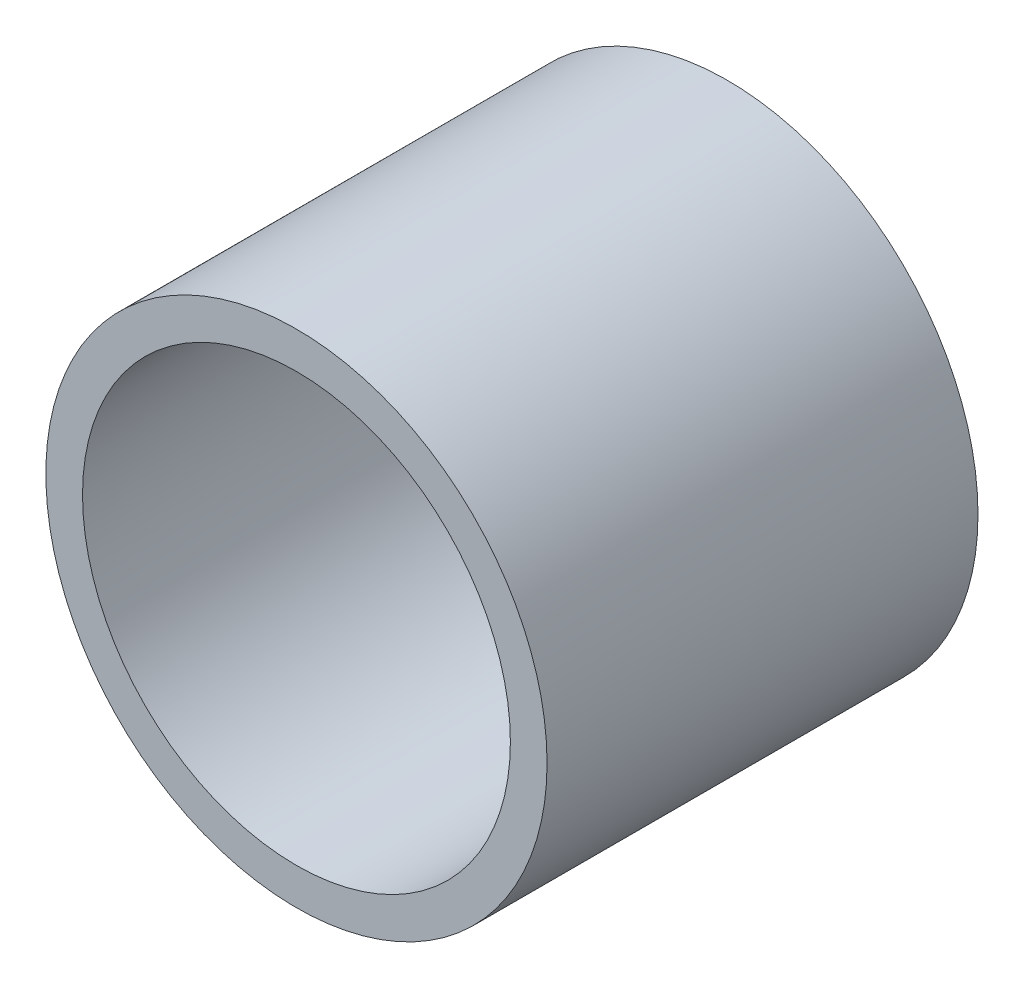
ISO-10303-21;
HEADER;
FILE_DESCRIPTION(('STEP AP214'),'2;1');
FILE_NAME('part.step','',(''),(''),'','','');
FILE_SCHEMA(('AUTOMOTIVE_DESIGN { 1 0 10303 214 1 1 1 1 }'));
ENDSEC;
DATA;
#1=APPLICATION_CONTEXT('core data for automotive mechanical design processes');
#2=APPLICATION_PROTOCOL_DEFINITION('international standard','automotive_design',2000,#1);
#3=PRODUCT_CONTEXT('',#1,'mechanical');
#4=PRODUCT('Part','Part','',(#3));
#5=PRODUCT_RELATED_PRODUCT_CATEGORY('part','',(#4));
#6=PRODUCT_DEFINITION_FORMATION('','',#4);
#7=PRODUCT_DEFINITION_CONTEXT('part definition',#1,'design');
#8=PRODUCT_DEFINITION('design','',#6,#7);
#9=PRODUCT_DEFINITION_SHAPE('','',#8);
#10=(LENGTH_UNIT() NAMED_UNIT(*) SI_UNIT(.MILLI.,.METRE.));
#11=(NAMED_UNIT(*) PLANE_ANGLE_UNIT() SI_UNIT($,.RADIAN.));
#12=(NAMED_UNIT(*) SI_UNIT($,.STERADIAN.) SOLID_ANGLE_UNIT());
#13=UNCERTAINTY_MEASURE_WITH_UNIT(LENGTH_MEASURE(1.E-05),#10,'distance_accuracy_value','');
#14=(GEOMETRIC_REPRESENTATION_CONTEXT(3) GLOBAL_UNCERTAINTY_ASSIGNED_CONTEXT((#13)) GLOBAL_UNIT_ASSIGNED_CONTEXT((#10,
#11,#12)) REPRESENTATION_CONTEXT('',''));
#15=CARTESIAN_POINT('',(0.,0.,0.));
#16=DIRECTION('',(0.,0.,1.));
#17=DIRECTION('',(1.,0.,0.));
#18=AXIS2_PLACEMENT_3D('',#15,#16,#17);
#19=CARTESIAN_POINT('',(0.,0.,70.5));
#20=DIRECTION('',(0.,0.,1.));
#21=DIRECTION('',(1.,0.,0.));
#22=AXIS2_PLACEMENT_3D('',#19,#20,#21);
#23=PLANE('',#22);
#24=CARTESIAN_POINT('',(0.,0.,70.5));
#25=DIRECTION('',(0.,0.,1.));
#26=DIRECTION('',(1.,0.,0.));
#27=AXIS2_PLACEMENT_3D('',#24,#25,#26);
#28=CIRCLE('',#27,41.);
#29=CARTESIAN_POINT('',(41.,0.,70.5));
#30=VERTEX_POINT('',#29);
#31=EDGE_CURVE('E10',#30,#30,#28,.T.);
#32=ORIENTED_EDGE('',*,*,#31,.T.);
#33=EDGE_LOOP('',(#32));
#34=FACE_BOUND('',#33,.T.);
#35=CARTESIAN_POINT('',(0.,0.,70.5));
#36=DIRECTION('',(0.,0.,1.));
#37=DIRECTION('',(1.,0.,0.));
#38=AXIS2_PLACEMENT_3D('',#35,#36,#37);
#39=CIRCLE('',#38,35.);
#40=CARTESIAN_POINT('',(35.,0.,70.5));
#41=VERTEX_POINT('',#40);
#42=EDGE_CURVE('E39',#41,#41,#39,.T.);
#43=ORIENTED_EDGE('',*,*,#42,.F.);
#44=EDGE_LOOP('',(#43));
#45=FACE_BOUND('',#44,.T.);
#46=ADVANCED_FACE('F28',(#34,#45),#23,.T.);
#47=CARTESIAN_POINT('',(0.,0.,0.));
#48=DIRECTION('',(0.,0.,1.));
#49=DIRECTION('',(1.,0.,0.));
#50=AXIS2_PLACEMENT_3D('',#47,#48,#49);
#51=PLANE('',#50);
#52=CARTESIAN_POINT('',(0.,0.,0.));
#53=DIRECTION('',(0.,0.,1.));
#54=DIRECTION('',(1.,0.,0.));
#55=AXIS2_PLACEMENT_3D('',#52,#53,#54);
#56=CIRCLE('',#55,41.);
#57=CARTESIAN_POINT('',(41.,0.,0.));
#58=VERTEX_POINT('',#57);
#59=EDGE_CURVE('E32',#58,#58,#56,.T.);
#60=ORIENTED_EDGE('',*,*,#59,.F.);
#61=EDGE_LOOP('',(#60));
#62=FACE_BOUND('',#61,.T.);
#63=CARTESIAN_POINT('',(0.,0.,0.));
#64=DIRECTION('',(0.,0.,1.));
#65=DIRECTION('',(1.,0.,0.));
#66=AXIS2_PLACEMENT_3D('',#63,#64,#65);
#67=CIRCLE('',#66,35.);
#68=CARTESIAN_POINT('',(35.,0.,0.));
#69=VERTEX_POINT('',#68);
#70=EDGE_CURVE('E41',#69,#69,#67,.T.);
#71=ORIENTED_EDGE('',*,*,#70,.T.);
#72=EDGE_LOOP('',(#71));
#73=FACE_BOUND('',#72,.T.);
#74=ADVANCED_FACE('F51',(#62,#73),#51,.F.);
#75=CARTESIAN_POINT('',(0.,0.,70.5));
#76=DIRECTION('',(0.,0.,-1.));
#77=DIRECTION('',(-1.,0.,0.));
#78=AXIS2_PLACEMENT_3D('',#75,#76,#77);
#79=CYLINDRICAL_SURFACE('',#78,41.);
#80=ORIENTED_EDGE('',*,*,#31,.F.);
#81=EDGE_LOOP('',(#80));
#82=FACE_BOUND('',#81,.T.);
#83=ORIENTED_EDGE('',*,*,#59,.T.);
#84=EDGE_LOOP('',(#83));
#85=FACE_BOUND('',#84,.T.);
#86=ADVANCED_FACE('F30',(#82,#85),#79,.T.);
#87=CARTESIAN_POINT('',(0.,0.,70.5));
#88=DIRECTION('',(0.,0.,-1.));
#89=DIRECTION('',(-1.,0.,0.));
#90=AXIS2_PLACEMENT_3D('',#87,#88,#89);
#91=CYLINDRICAL_SURFACE('',#90,35.);
#92=ORIENTED_EDGE('',*,*,#42,.T.);
#93=EDGE_LOOP('',(#92));
#94=FACE_BOUND('',#93,.T.);
#95=ORIENTED_EDGE('',*,*,#70,.F.);
#96=EDGE_LOOP('',(#95));
#97=FACE_BOUND('',#96,.T.);
#98=ADVANCED_FACE('F47',(#94,#97),#91,.F.);
#99=CLOSED_SHELL('',(#46,#74,#86,#98));
#100=MANIFOLD_SOLID_BREP('B2',#99);
#101=ADVANCED_BREP_SHAPE_REPRESENTATION('',(#18,#100),#14);
#102=SHAPE_DEFINITION_REPRESENTATION(#9,#101);
ENDSEC;
END-ISO-10303-21;
